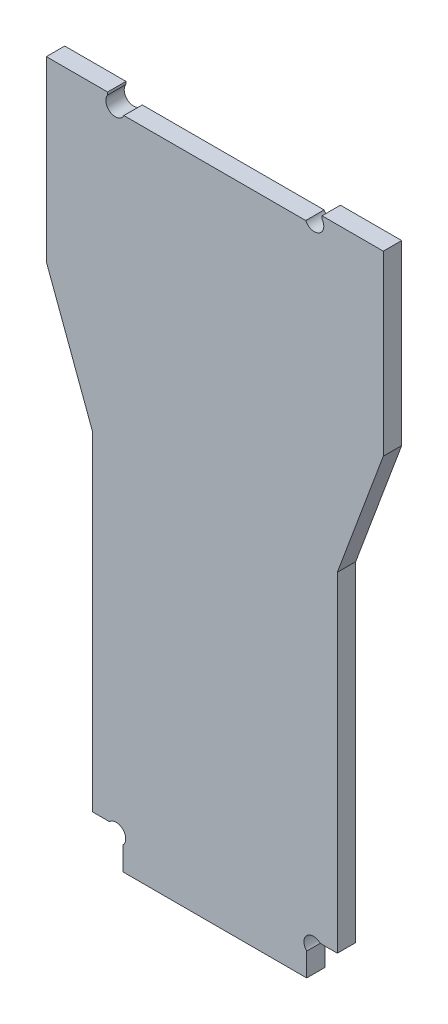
from build123d import *

# Parameters (mm, degrees)
EXTRUSION1_DEPTH = 3


with BuildPart() as part:
    # Esquisse1 → Extrusion1 (new body)
    with BuildSketch(Plane.XY):
        with BuildLine():
            Line((32.5, 6), (32.5, 59.858238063))
            Line((32.5, 59.858238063), (25, 80))
            Line((25, 80), (25, 109))
            Line((25, 109), (35, 109))
            Line((35, 109), (35, 108.574329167))
            ThreePointArc((35, 108.574329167), (35.470787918, 106.33929374), (37.657221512, 107))
            Line((37.657221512, 107), (67.342778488, 107))
            ThreePointArc((67.342778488, 107), (69.529212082, 106.33929374), (70, 108.574329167))
            Line((70, 108.574329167), (70, 109))
            Line((70, 109), (80, 109))
            Line((80, 109), (80, 80))
            Line((80, 80), (72.5, 59.858238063))
            Line((72.5, 59.858238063), (72.5, 6))
            Line((72.5, 6), (69.692031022, 6))
            ThreePointArc((69.692031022, 6), (67.5, 6), (67.5, 3.807968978))
            Line((67.5, 3.807968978), (67.5, 0))
            Line((67.5, 0), (37.5, 0))
            Line((37.5, 0), (37.5, 3.807968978))
            ThreePointArc((37.5, 3.807968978), (37.5, 6), (35.307968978, 6))
            Line((35.307968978, 6), (32.5, 6))
        make_face()
    extrude(amount=EXTRUSION1_DEPTH)


solid = part.part
